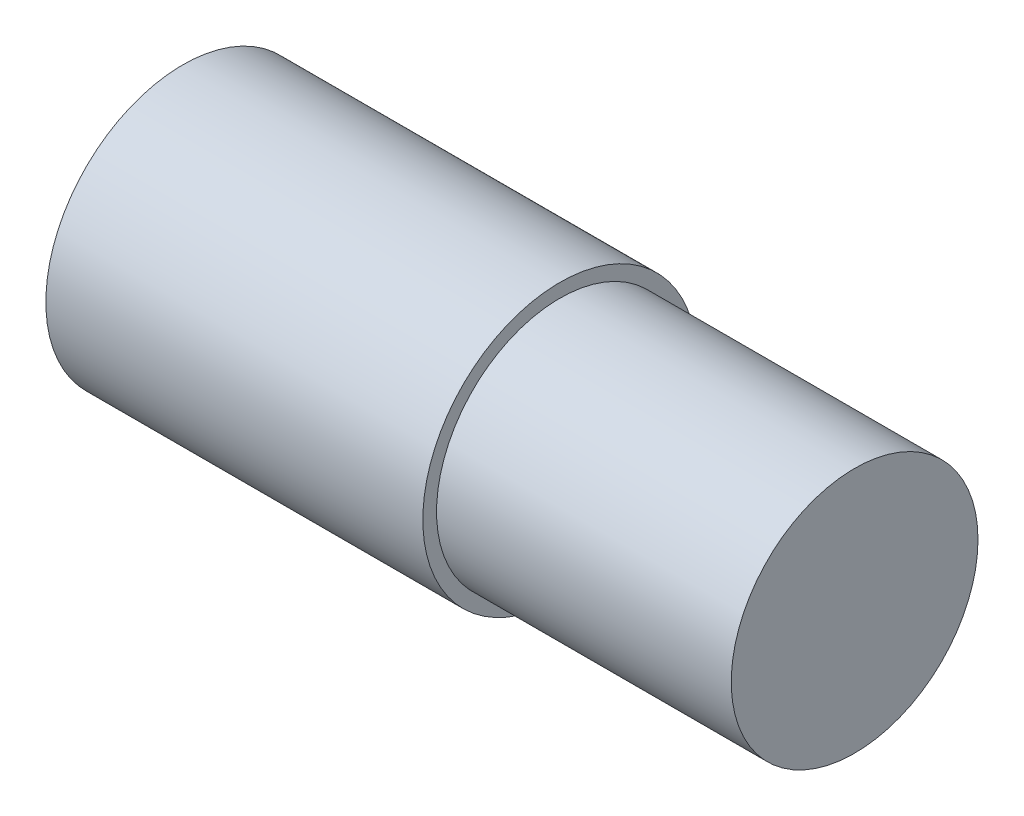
ISO-10303-21;
HEADER;
FILE_DESCRIPTION(('STEP AP214'),'2;1');
FILE_NAME('part.step','',(''),(''),'','','');
FILE_SCHEMA(('AUTOMOTIVE_DESIGN { 1 0 10303 214 1 1 1 1 }'));
ENDSEC;
DATA;
#1=APPLICATION_CONTEXT('core data for automotive mechanical design processes');
#2=APPLICATION_PROTOCOL_DEFINITION('international standard','automotive_design',2000,#1);
#3=PRODUCT_CONTEXT('',#1,'mechanical');
#4=PRODUCT('Part','Part','',(#3));
#5=PRODUCT_RELATED_PRODUCT_CATEGORY('part','',(#4));
#6=PRODUCT_DEFINITION_FORMATION('','',#4);
#7=PRODUCT_DEFINITION_CONTEXT('part definition',#1,'design');
#8=PRODUCT_DEFINITION('design','',#6,#7);
#9=PRODUCT_DEFINITION_SHAPE('','',#8);
#10=(LENGTH_UNIT() NAMED_UNIT(*) SI_UNIT(.MILLI.,.METRE.));
#11=(NAMED_UNIT(*) PLANE_ANGLE_UNIT() SI_UNIT($,.RADIAN.));
#12=(NAMED_UNIT(*) SI_UNIT($,.STERADIAN.) SOLID_ANGLE_UNIT());
#13=UNCERTAINTY_MEASURE_WITH_UNIT(LENGTH_MEASURE(1.E-05),#10,'distance_accuracy_value','');
#14=(GEOMETRIC_REPRESENTATION_CONTEXT(3) GLOBAL_UNCERTAINTY_ASSIGNED_CONTEXT((#13)) GLOBAL_UNIT_ASSIGNED_CONTEXT((#10,
#11,#12)) REPRESENTATION_CONTEXT('',''));
#15=CARTESIAN_POINT('',(0.,0.,0.));
#16=DIRECTION('',(0.,0.,1.));
#17=DIRECTION('',(1.,0.,0.));
#18=AXIS2_PLACEMENT_3D('',#15,#16,#17);
#19=CARTESIAN_POINT('',(550.,0.,0.));
#20=DIRECTION('',(-1.,0.,0.));
#21=DIRECTION('',(0.,0.,1.));
#22=AXIS2_PLACEMENT_3D('',#19,#20,#21);
#23=CYLINDRICAL_SURFACE('',#22,200.);
#24=CARTESIAN_POINT('',(550.,0.,0.));
#25=DIRECTION('',(1.,0.,0.));
#26=DIRECTION('',(0.,0.,-1.));
#27=AXIS2_PLACEMENT_3D('',#24,#25,#26);
#28=CIRCLE('',#27,200.);
#29=CARTESIAN_POINT('',(550.,0.,-200.));
#30=VERTEX_POINT('',#29);
#31=EDGE_CURVE('E10',#30,#30,#28,.T.);
#32=ORIENTED_EDGE('',*,*,#31,.F.);
#33=EDGE_LOOP('',(#32));
#34=FACE_BOUND('',#33,.T.);
#35=CARTESIAN_POINT('',(0.,0.,0.));
#36=DIRECTION('',(1.,0.,0.));
#37=DIRECTION('',(0.,0.,-1.));
#38=AXIS2_PLACEMENT_3D('',#35,#36,#37);
#39=CIRCLE('',#38,200.);
#40=CARTESIAN_POINT('',(0.,0.,-200.));
#41=VERTEX_POINT('',#40);
#42=EDGE_CURVE('E37',#41,#41,#39,.T.);
#43=ORIENTED_EDGE('',*,*,#42,.T.);
#44=EDGE_LOOP('',(#43));
#45=FACE_BOUND('',#44,.T.);
#46=ADVANCED_FACE('F40',(#34,#45),#23,.T.);
#47=CARTESIAN_POINT('',(550.,0.,0.));
#48=DIRECTION('',(1.,0.,0.));
#49=DIRECTION('',(0.,0.,-1.));
#50=AXIS2_PLACEMENT_3D('',#47,#48,#49);
#51=PLANE('',#50);
#52=CARTESIAN_POINT('',(550.,0.,0.));
#53=DIRECTION('',(1.,0.,0.));
#54=DIRECTION('',(0.,0.,-1.));
#55=AXIS2_PLACEMENT_3D('',#52,#53,#54);
#56=CIRCLE('',#55,180.);
#57=CARTESIAN_POINT('',(550.,0.,-180.));
#58=VERTEX_POINT('',#57);
#59=EDGE_CURVE('E50',#58,#58,#56,.F.);
#60=ORIENTED_EDGE('',*,*,#59,.T.);
#61=EDGE_LOOP('',(#60));
#62=FACE_BOUND('',#61,.T.);
#63=ORIENTED_EDGE('',*,*,#31,.T.);
#64=EDGE_LOOP('',(#63));
#65=FACE_BOUND('',#64,.T.);
#66=ADVANCED_FACE('F70',(#62,#65),#51,.T.);
#67=CARTESIAN_POINT('',(0.,0.,0.));
#68=DIRECTION('',(1.,0.,0.));
#69=DIRECTION('',(0.,0.,-1.));
#70=AXIS2_PLACEMENT_3D('',#67,#68,#69);
#71=PLANE('',#70);
#72=ORIENTED_EDGE('',*,*,#42,.F.);
#73=EDGE_LOOP('',(#72));
#74=FACE_BOUND('',#73,.T.);
#75=ADVANCED_FACE('F56',(#74),#71,.F.);
#76=CARTESIAN_POINT('',(980.,0.,0.));
#77=DIRECTION('',(-1.,0.,0.));
#78=DIRECTION('',(0.,0.,1.));
#79=AXIS2_PLACEMENT_3D('',#76,#77,#78);
#80=CYLINDRICAL_SURFACE('',#79,180.);
#81=ORIENTED_EDGE('',*,*,#59,.F.);
#82=EDGE_LOOP('',(#81));
#83=FACE_BOUND('',#82,.T.);
#84=CARTESIAN_POINT('',(980.,0.,0.));
#85=DIRECTION('',(1.,0.,0.));
#86=DIRECTION('',(0.,0.,-1.));
#87=AXIS2_PLACEMENT_3D('',#84,#85,#86);
#88=CIRCLE('',#87,180.);
#89=CARTESIAN_POINT('',(980.,0.,-180.));
#90=VERTEX_POINT('',#89);
#91=EDGE_CURVE('E51',#90,#90,#88,.T.);
#92=ORIENTED_EDGE('',*,*,#91,.F.);
#93=EDGE_LOOP('',(#92));
#94=FACE_BOUND('',#93,.T.);
#95=ADVANCED_FACE('F60',(#83,#94),#80,.T.);
#96=CARTESIAN_POINT('',(980.,0.,0.));
#97=DIRECTION('',(1.,0.,0.));
#98=DIRECTION('',(0.,0.,-1.));
#99=AXIS2_PLACEMENT_3D('',#96,#97,#98);
#100=PLANE('',#99);
#101=ORIENTED_EDGE('',*,*,#91,.T.);
#102=EDGE_LOOP('',(#101));
#103=FACE_BOUND('',#102,.T.);
#104=ADVANCED_FACE('F54',(#103),#100,.T.);
#105=CLOSED_SHELL('',(#46,#66,#75,#95,#104));
#106=MANIFOLD_SOLID_BREP('B2',#105);
#107=ADVANCED_BREP_SHAPE_REPRESENTATION('',(#18,#106),#14);
#108=SHAPE_DEFINITION_REPRESENTATION(#9,#107);
ENDSEC;
END-ISO-10303-21;
